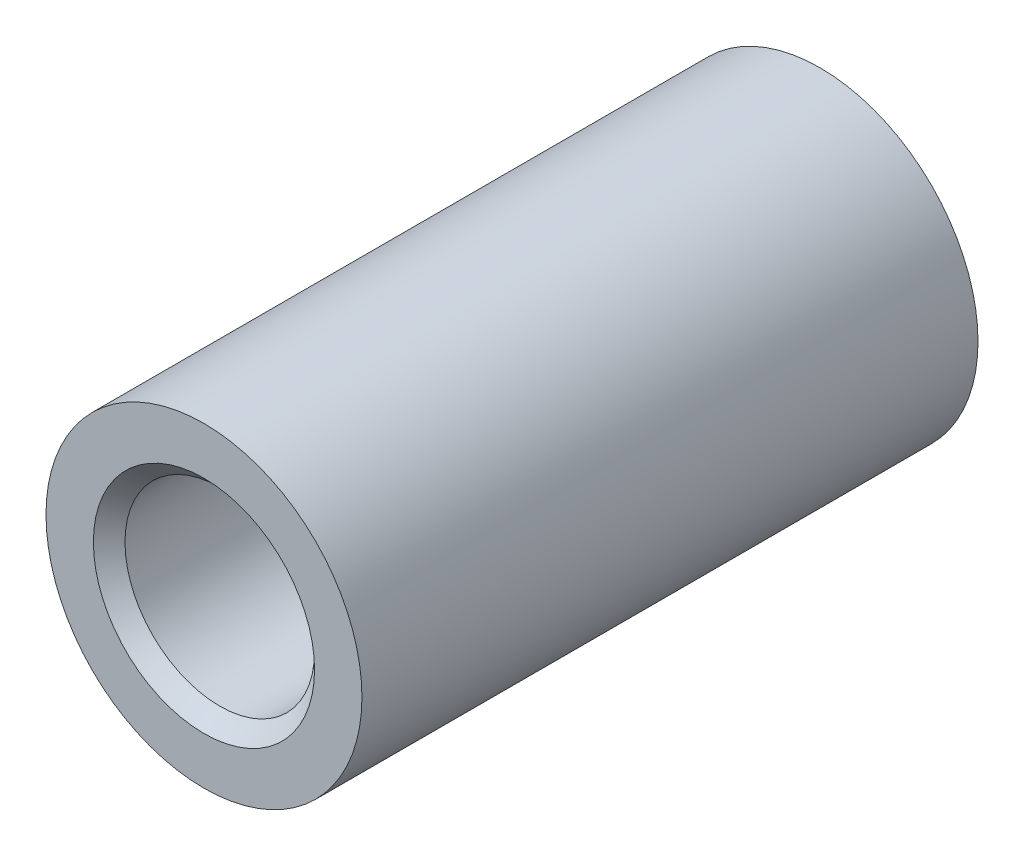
from build123d import *

# Parameters (mm, degrees)
BOSS_EXTRU_1_DEPTH      = 9.75
BOSS_EXTRU_1_DEPTH_BACK = 9.75
ESQUISSE1_R             = 5
ESQUISSE1_R_2           = 3
CHANFREIN1_SIZE         = 0.5


with BuildPart() as part:
    # Esquisse1 → Boss.-Extru.1 (new, two sides: drawn at the far end of the back side and taken through both)
    with BuildSketch(Plane.XY.offset(-BOSS_EXTRU_1_DEPTH_BACK)):
        Circle(ESQUISSE1_R)
        Circle(ESQUISSE1_R_2, mode=Mode.SUBTRACT)
    extrude(amount=BOSS_EXTRU_1_DEPTH + BOSS_EXTRU_1_DEPTH_BACK)

    # Chanfrein1
    chanfrein1_edges = [part.edges().sort_by_distance(p)[0] for p in [
        (-3, 0, -9.75),
        (-3, 0, 9.75),
    ]]
    chamfer(chanfrein1_edges, length=CHANFREIN1_SIZE)


solid = part.part
